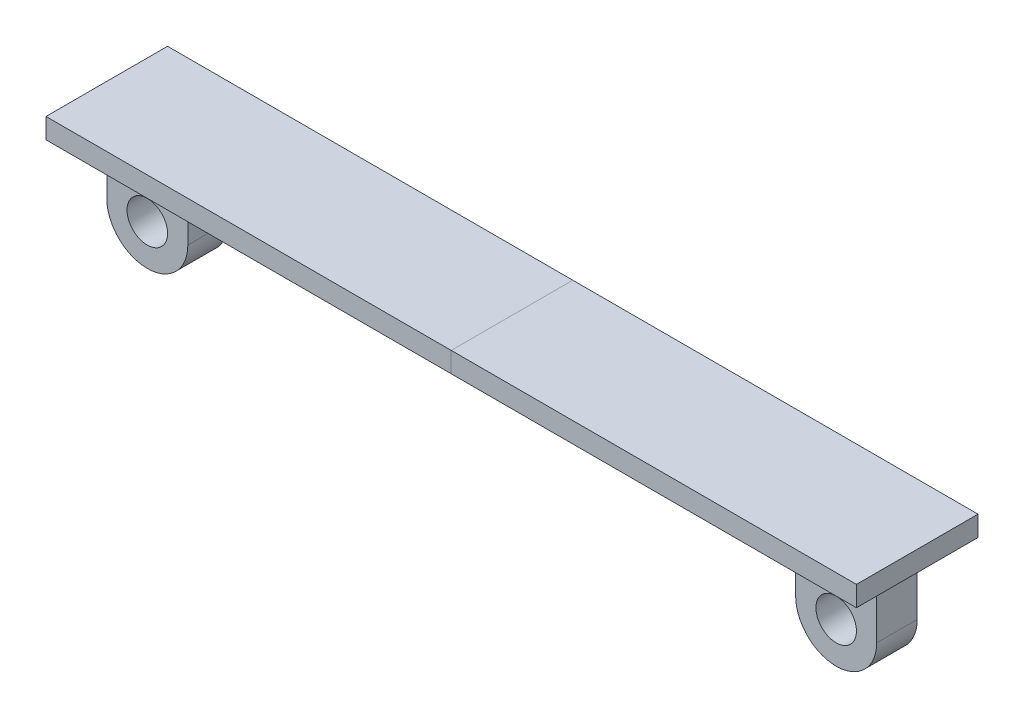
ISO-10303-21;
HEADER;
FILE_DESCRIPTION(('STEP AP214'),'2;1');
FILE_NAME('part.step','',(''),(''),'','','');
FILE_SCHEMA(('AUTOMOTIVE_DESIGN { 1 0 10303 214 1 1 1 1 }'));
ENDSEC;
DATA;
#1=APPLICATION_CONTEXT('core data for automotive mechanical design processes');
#2=APPLICATION_PROTOCOL_DEFINITION('international standard','automotive_design',2000,#1);
#3=PRODUCT_CONTEXT('',#1,'mechanical');
#4=PRODUCT('Part','Part','',(#3));
#5=PRODUCT_RELATED_PRODUCT_CATEGORY('part','',(#4));
#6=PRODUCT_DEFINITION_FORMATION('','',#4);
#7=PRODUCT_DEFINITION_CONTEXT('part definition',#1,'design');
#8=PRODUCT_DEFINITION('design','',#6,#7);
#9=PRODUCT_DEFINITION_SHAPE('','',#8);
#10=(LENGTH_UNIT() NAMED_UNIT(*) SI_UNIT(.MILLI.,.METRE.));
#11=(NAMED_UNIT(*) PLANE_ANGLE_UNIT() SI_UNIT($,.RADIAN.));
#12=(NAMED_UNIT(*) SI_UNIT($,.STERADIAN.) SOLID_ANGLE_UNIT());
#13=UNCERTAINTY_MEASURE_WITH_UNIT(LENGTH_MEASURE(1.E-05),#10,'distance_accuracy_value','');
#14=(GEOMETRIC_REPRESENTATION_CONTEXT(3) GLOBAL_UNCERTAINTY_ASSIGNED_CONTEXT((#13)) GLOBAL_UNIT_ASSIGNED_CONTEXT((#10,
#11,#12)) REPRESENTATION_CONTEXT('',''));
#15=CARTESIAN_POINT('',(0.,0.,0.));
#16=DIRECTION('',(0.,0.,1.));
#17=DIRECTION('',(1.,0.,0.));
#18=AXIS2_PLACEMENT_3D('',#15,#16,#17);
#19=CARTESIAN_POINT('',(-200.,-10.,-30.));
#20=DIRECTION('',(0.,1.,0.));
#21=DIRECTION('',(0.,0.,1.));
#22=AXIS2_PLACEMENT_3D('',#19,#20,#21);
#23=PLANE('',#22);
#24=DIRECTION('',(1.,0.,0.));
#25=VECTOR('',#24,1.);
#26=CARTESIAN_POINT('',(-190.,-10.,-9.99999999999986));
#27=LINE('',#26,#25);
#28=CARTESIAN_POINT('',(-195.,-10.,-9.99999999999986));
#29=VERTEX_POINT('',#28);
#30=CARTESIAN_POINT('',(-145.,-10.,-9.99999999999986));
#31=VERTEX_POINT('',#30);
#32=EDGE_CURVE('E387',#29,#31,#27,.T.);
#33=ORIENTED_EDGE('',*,*,#32,.F.);
#34=DIRECTION('',(0.,0.,-1.));
#35=VECTOR('',#34,1.);
#36=CARTESIAN_POINT('',(-195.,-10.,10.));
#37=LINE('',#36,#35);
#38=CARTESIAN_POINT('',(-195.,-10.,10.));
#39=VERTEX_POINT('',#38);
#40=EDGE_CURVE('E248',#29,#39,#37,.F.);
#41=ORIENTED_EDGE('',*,*,#40,.T.);
#42=DIRECTION('',(-1.,0.,0.));
#43=VECTOR('',#42,1.);
#44=CARTESIAN_POINT('',(-190.,-10.,10.));
#45=LINE('',#44,#43);
#46=CARTESIAN_POINT('',(-145.,-10.,10.));
#47=VERTEX_POINT('',#46);
#48=EDGE_CURVE('E389',#47,#39,#45,.T.);
#49=ORIENTED_EDGE('',*,*,#48,.F.);
#50=DIRECTION('',(0.,0.,1.));
#51=VECTOR('',#50,1.);
#52=CARTESIAN_POINT('',(-145.,-10.,-9.99999999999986));
#53=LINE('',#52,#51);
#54=EDGE_CURVE('E245',#47,#31,#53,.F.);
#55=ORIENTED_EDGE('',*,*,#54,.T.);
#56=EDGE_LOOP('',(#33,#41,#49,#55));
#57=FACE_BOUND('',#56,.T.);
#58=DIRECTION('',(0.,0.,-1.));
#59=VECTOR('',#58,1.);
#60=CARTESIAN_POINT('',(0.,-10.,-30.));
#61=LINE('',#60,#59);
#62=CARTESIAN_POINT('',(0.,-10.,30.));
#63=VERTEX_POINT('',#62);
#64=CARTESIAN_POINT('',(0.,-10.,-30.));
#65=VERTEX_POINT('',#64);
#66=EDGE_CURVE('E11',#63,#65,#61,.T.);
#67=ORIENTED_EDGE('',*,*,#66,.F.);
#68=DIRECTION('',(1.,0.,0.));
#69=VECTOR('',#68,1.);
#70=CARTESIAN_POINT('',(-200.,-10.,30.));
#71=LINE('',#70,#69);
#72=CARTESIAN_POINT('',(-200.,-10.,30.));
#73=VERTEX_POINT('',#72);
#74=EDGE_CURVE('E210',#73,#63,#71,.T.);
#75=ORIENTED_EDGE('',*,*,#74,.F.);
#76=DIRECTION('',(0.,0.,1.));
#77=VECTOR('',#76,1.);
#78=CARTESIAN_POINT('',(-200.,-10.,-30.));
#79=LINE('',#78,#77);
#80=CARTESIAN_POINT('',(-200.,-10.,-30.));
#81=VERTEX_POINT('',#80);
#82=EDGE_CURVE('E176',#81,#73,#79,.T.);
#83=ORIENTED_EDGE('',*,*,#82,.F.);
#84=DIRECTION('',(-1.,0.,0.));
#85=VECTOR('',#84,1.);
#86=CARTESIAN_POINT('',(-200.,-10.,-30.));
#87=LINE('',#86,#85);
#88=EDGE_CURVE('E215',#65,#81,#87,.T.);
#89=ORIENTED_EDGE('',*,*,#88,.F.);
#90=EDGE_LOOP('',(#67,#75,#83,#89));
#91=FACE_BOUND('',#90,.T.);
#92=ADVANCED_FACE('F32',(#57,#91),#23,.F.);
#93=CARTESIAN_POINT('',(-200.,-10.,-30.));
#94=DIRECTION('',(0.,0.,-1.));
#95=DIRECTION('',(-1.,0.,0.));
#96=AXIS2_PLACEMENT_3D('',#93,#94,#95);
#97=PLANE('',#96);
#98=DIRECTION('',(-1.,0.,0.));
#99=VECTOR('',#98,1.);
#100=CARTESIAN_POINT('',(-200.,0.,-30.));
#101=LINE('',#100,#99);
#102=CARTESIAN_POINT('',(0.,0.,-30.));
#103=VERTEX_POINT('',#102);
#104=CARTESIAN_POINT('',(-200.,0.,-30.));
#105=VERTEX_POINT('',#104);
#106=EDGE_CURVE('E194',#103,#105,#101,.T.);
#107=ORIENTED_EDGE('',*,*,#106,.F.);
#108=DIRECTION('',(0.,-1.,0.));
#109=VECTOR('',#108,1.);
#110=CARTESIAN_POINT('',(0.,-10.,-30.));
#111=LINE('',#110,#109);
#112=EDGE_CURVE('E42',#103,#65,#111,.T.);
#113=ORIENTED_EDGE('',*,*,#112,.T.);
#114=ORIENTED_EDGE('',*,*,#88,.T.);
#115=DIRECTION('',(0.,1.,0.));
#116=VECTOR('',#115,1.);
#117=CARTESIAN_POINT('',(-200.,-10.,-30.));
#118=LINE('',#117,#116);
#119=EDGE_CURVE('E218',#81,#105,#118,.T.);
#120=ORIENTED_EDGE('',*,*,#119,.T.);
#121=EDGE_LOOP('',(#107,#113,#114,#120));
#122=FACE_BOUND('',#121,.T.);
#123=ADVANCED_FACE('F303',(#122),#97,.T.);
#124=CARTESIAN_POINT('',(-200.,-10.,30.));
#125=DIRECTION('',(0.,0.,1.));
#126=DIRECTION('',(1.,0.,0.));
#127=AXIS2_PLACEMENT_3D('',#124,#125,#126);
#128=PLANE('',#127);
#129=ORIENTED_EDGE('',*,*,#74,.T.);
#130=DIRECTION('',(0.,1.,0.));
#131=VECTOR('',#130,1.);
#132=CARTESIAN_POINT('',(0.,-10.,30.));
#133=LINE('',#132,#131);
#134=CARTESIAN_POINT('',(0.,0.,30.));
#135=VERTEX_POINT('',#134);
#136=EDGE_CURVE('E185',#63,#135,#133,.T.);
#137=ORIENTED_EDGE('',*,*,#136,.T.);
#138=DIRECTION('',(1.,0.,0.));
#139=VECTOR('',#138,1.);
#140=CARTESIAN_POINT('',(-200.,0.,30.));
#141=LINE('',#140,#139);
#142=CARTESIAN_POINT('',(-200.,0.,30.));
#143=VERTEX_POINT('',#142);
#144=EDGE_CURVE('E183',#143,#135,#141,.T.);
#145=ORIENTED_EDGE('',*,*,#144,.F.);
#146=DIRECTION('',(0.,1.,0.));
#147=VECTOR('',#146,1.);
#148=CARTESIAN_POINT('',(-200.,-10.,30.));
#149=LINE('',#148,#147);
#150=EDGE_CURVE('E170',#73,#143,#149,.T.);
#151=ORIENTED_EDGE('',*,*,#150,.F.);
#152=EDGE_LOOP('',(#129,#137,#145,#151));
#153=FACE_BOUND('',#152,.T.);
#154=ADVANCED_FACE('F184',(#153),#128,.T.);
#155=CARTESIAN_POINT('',(-200.,0.,-30.));
#156=DIRECTION('',(0.,1.,0.));
#157=DIRECTION('',(0.,0.,1.));
#158=AXIS2_PLACEMENT_3D('',#155,#156,#157);
#159=PLANE('',#158);
#160=ORIENTED_EDGE('',*,*,#144,.T.);
#161=DIRECTION('',(0.,0.,-1.));
#162=VECTOR('',#161,1.);
#163=CARTESIAN_POINT('',(0.,0.,-30.));
#164=LINE('',#163,#162);
#165=EDGE_CURVE('E36',#135,#103,#164,.T.);
#166=ORIENTED_EDGE('',*,*,#165,.T.);
#167=ORIENTED_EDGE('',*,*,#106,.T.);
#168=DIRECTION('',(0.,0.,1.));
#169=VECTOR('',#168,1.);
#170=CARTESIAN_POINT('',(-200.,0.,-30.));
#171=LINE('',#170,#169);
#172=EDGE_CURVE('E174',#105,#143,#171,.T.);
#173=ORIENTED_EDGE('',*,*,#172,.T.);
#174=EDGE_LOOP('',(#160,#166,#167,#173));
#175=FACE_BOUND('',#174,.T.);
#176=ADVANCED_FACE('F192',(#175),#159,.T.);
#177=CARTESIAN_POINT('',(190.,-60.,10.));
#178=DIRECTION('',(0.,0.,1.));
#179=DIRECTION('',(1.,0.,0.));
#180=AXIS2_PLACEMENT_3D('',#177,#178,#179);
#181=PLANE('',#180);
#182=DIRECTION('',(0.,1.,0.));
#183=VECTOR('',#182,1.);
#184=CARTESIAN_POINT('',(150.,-60.,10.));
#185=LINE('',#184,#183);
#186=CARTESIAN_POINT('',(150.,-40.,10.));
#187=VERTEX_POINT('',#186);
#188=CARTESIAN_POINT('',(150.,-15.,10.));
#189=VERTEX_POINT('',#188);
#190=EDGE_CURVE('E374',#187,#189,#185,.T.);
#191=ORIENTED_EDGE('',*,*,#190,.F.);
#192=CARTESIAN_POINT('',(170.,-40.,10.));
#193=DIRECTION('',(0.,0.,1.));
#194=DIRECTION('',(1.,0.,0.));
#195=AXIS2_PLACEMENT_3D('',#192,#193,#194);
#196=CIRCLE('',#195,20.);
#197=CARTESIAN_POINT('',(170.,-60.,10.));
#198=VERTEX_POINT('',#197);
#199=EDGE_CURVE('E269',#187,#198,#196,.T.);
#200=ORIENTED_EDGE('',*,*,#199,.T.);
#201=CARTESIAN_POINT('',(170.,-40.,10.));
#202=DIRECTION('',(0.,0.,1.));
#203=DIRECTION('',(1.,0.,0.));
#204=AXIS2_PLACEMENT_3D('',#201,#202,#203);
#205=CIRCLE('',#204,20.);
#206=CARTESIAN_POINT('',(190.,-40.,10.));
#207=VERTEX_POINT('',#206);
#208=EDGE_CURVE('E267',#198,#207,#205,.T.);
#209=ORIENTED_EDGE('',*,*,#208,.T.);
#210=DIRECTION('',(0.,1.,0.));
#211=VECTOR('',#210,1.);
#212=CARTESIAN_POINT('',(190.,-60.,10.));
#213=LINE('',#212,#211);
#214=CARTESIAN_POINT('',(190.,-15.,10.));
#215=VERTEX_POINT('',#214);
#216=EDGE_CURVE('E381',#207,#215,#213,.T.);
#217=ORIENTED_EDGE('',*,*,#216,.T.);
#218=CARTESIAN_POINT('',(195.,-15.,10.));
#219=DIRECTION('',(0.,0.,1.));
#220=DIRECTION('',(1.,0.,0.));
#221=AXIS2_PLACEMENT_3D('',#218,#219,#220);
#222=CIRCLE('',#221,5.);
#223=CARTESIAN_POINT('',(195.,-10.,10.));
#224=VERTEX_POINT('',#223);
#225=EDGE_CURVE('E289',#215,#224,#222,.F.);
#226=ORIENTED_EDGE('',*,*,#225,.T.);
#227=DIRECTION('',(1.,0.,0.));
#228=VECTOR('',#227,1.);
#229=CARTESIAN_POINT('',(190.,-10.,10.));
#230=LINE('',#229,#228);
#231=CARTESIAN_POINT('',(145.,-10.,10.));
#232=VERTEX_POINT('',#231);
#233=EDGE_CURVE('E355',#232,#224,#230,.T.);
#234=ORIENTED_EDGE('',*,*,#233,.F.);
#235=CARTESIAN_POINT('',(145.,-15.,10.));
#236=DIRECTION('',(0.,0.,1.));
#237=DIRECTION('',(1.,0.,0.));
#238=AXIS2_PLACEMENT_3D('',#235,#236,#237);
#239=CIRCLE('',#238,5.);
#240=EDGE_CURVE('E292',#232,#189,#239,.F.);
#241=ORIENTED_EDGE('',*,*,#240,.T.);
#242=EDGE_LOOP('',(#191,#200,#209,#217,#226,#234,#241));
#243=FACE_BOUND('',#242,.T.);
#244=CARTESIAN_POINT('',(170.,-40.,10.));
#245=DIRECTION('',(0.,0.,1.));
#246=DIRECTION('',(1.,0.,0.));
#247=AXIS2_PLACEMENT_3D('',#244,#245,#246);
#248=CIRCLE('',#247,10.);
#249=CARTESIAN_POINT('',(160.,-40.,10.));
#250=VERTEX_POINT('',#249);
#251=EDGE_CURVE('E621',#250,#250,#248,.F.);
#252=ORIENTED_EDGE('',*,*,#251,.T.);
#253=EDGE_LOOP('',(#252));
#254=FACE_BOUND('',#253,.T.);
#255=ADVANCED_FACE('F335',(#243,#254),#181,.T.);
#256=CARTESIAN_POINT('',(190.,-60.,-9.99999999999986));
#257=DIRECTION('',(0.,0.,-1.));
#258=DIRECTION('',(-1.,0.,0.));
#259=AXIS2_PLACEMENT_3D('',#256,#257,#258);
#260=PLANE('',#259);
#261=CARTESIAN_POINT('',(170.,-40.,-9.99999999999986));
#262=DIRECTION('',(0.,0.,-1.));
#263=DIRECTION('',(-1.,0.,0.));
#264=AXIS2_PLACEMENT_3D('',#261,#262,#263);
#265=CIRCLE('',#264,20.);
#266=CARTESIAN_POINT('',(190.,-40.,-9.99999999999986));
#267=VERTEX_POINT('',#266);
#268=CARTESIAN_POINT('',(170.,-60.,-9.99999999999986));
#269=VERTEX_POINT('',#268);
#270=EDGE_CURVE('E271',#267,#269,#265,.T.);
#271=ORIENTED_EDGE('',*,*,#270,.T.);
#272=CARTESIAN_POINT('',(170.,-40.,-9.99999999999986));
#273=DIRECTION('',(0.,0.,-1.));
#274=DIRECTION('',(-1.,0.,0.));
#275=AXIS2_PLACEMENT_3D('',#272,#273,#274);
#276=CIRCLE('',#275,20.);
#277=CARTESIAN_POINT('',(150.,-40.,-9.99999999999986));
#278=VERTEX_POINT('',#277);
#279=EDGE_CURVE('E273',#269,#278,#276,.T.);
#280=ORIENTED_EDGE('',*,*,#279,.T.);
#281=DIRECTION('',(0.,1.,0.));
#282=VECTOR('',#281,1.);
#283=CARTESIAN_POINT('',(150.,-60.,-9.99999999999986));
#284=LINE('',#283,#282);
#285=CARTESIAN_POINT('',(150.,-15.,-9.99999999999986));
#286=VERTEX_POINT('',#285);
#287=EDGE_CURVE('E371',#278,#286,#284,.T.);
#288=ORIENTED_EDGE('',*,*,#287,.T.);
#289=CARTESIAN_POINT('',(145.,-15.,-9.99999999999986));
#290=DIRECTION('',(0.,0.,-1.));
#291=DIRECTION('',(-1.,0.,0.));
#292=AXIS2_PLACEMENT_3D('',#289,#290,#291);
#293=CIRCLE('',#292,5.);
#294=CARTESIAN_POINT('',(145.,-10.,-9.99999999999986));
#295=VERTEX_POINT('',#294);
#296=EDGE_CURVE('E294',#286,#295,#293,.F.);
#297=ORIENTED_EDGE('',*,*,#296,.T.);
#298=DIRECTION('',(-1.,0.,0.));
#299=VECTOR('',#298,1.);
#300=CARTESIAN_POINT('',(190.,-10.,-9.99999999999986));
#301=LINE('',#300,#299);
#302=CARTESIAN_POINT('',(195.,-10.,-9.99999999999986));
#303=VERTEX_POINT('',#302);
#304=EDGE_CURVE('E354',#303,#295,#301,.T.);
#305=ORIENTED_EDGE('',*,*,#304,.F.);
#306=CARTESIAN_POINT('',(195.,-15.,-9.99999999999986));
#307=DIRECTION('',(0.,0.,-1.));
#308=DIRECTION('',(-1.,0.,0.));
#309=AXIS2_PLACEMENT_3D('',#306,#307,#308);
#310=CIRCLE('',#309,5.);
#311=CARTESIAN_POINT('',(190.,-15.,-9.99999999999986));
#312=VERTEX_POINT('',#311);
#313=EDGE_CURVE('E287',#303,#312,#310,.F.);
#314=ORIENTED_EDGE('',*,*,#313,.T.);
#315=DIRECTION('',(0.,1.,0.));
#316=VECTOR('',#315,1.);
#317=CARTESIAN_POINT('',(190.,-60.,-9.99999999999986));
#318=LINE('',#317,#316);
#319=EDGE_CURVE('E364',#267,#312,#318,.T.);
#320=ORIENTED_EDGE('',*,*,#319,.F.);
#321=EDGE_LOOP('',(#271,#280,#288,#297,#305,#314,#320));
#322=FACE_BOUND('',#321,.T.);
#323=CARTESIAN_POINT('',(170.,-40.,-9.99999999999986));
#324=DIRECTION('',(0.,0.,1.));
#325=DIRECTION('',(1.,0.,0.));
#326=AXIS2_PLACEMENT_3D('',#323,#324,#325);
#327=CIRCLE('',#326,10.);
#328=CARTESIAN_POINT('',(160.,-40.,-9.99999999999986));
#329=VERTEX_POINT('',#328);
#330=EDGE_CURVE('E624',#329,#329,#327,.T.);
#331=ORIENTED_EDGE('',*,*,#330,.T.);
#332=EDGE_LOOP('',(#331));
#333=FACE_BOUND('',#332,.T.);
#334=ADVANCED_FACE('F344',(#322,#333),#260,.T.);
#335=DIRECTION('',(0.,0.,-1.));
#336=VECTOR('',#335,1.);
#337=CARTESIAN_POINT('',(195.,-10.,-29.9999999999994));
#338=LINE('',#337,#336);
#339=EDGE_CURVE('E280',#224,#303,#338,.T.);
#340=ORIENTED_EDGE('',*,*,#339,.T.);
#341=ORIENTED_EDGE('',*,*,#304,.T.);
#342=DIRECTION('',(0.,0.,1.));
#343=VECTOR('',#342,1.);
#344=CARTESIAN_POINT('',(145.,-10.,-30.));
#345=LINE('',#344,#343);
#346=EDGE_CURVE('E277',#295,#232,#345,.T.);
#347=ORIENTED_EDGE('',*,*,#346,.T.);
#348=ORIENTED_EDGE('',*,*,#233,.T.);
#349=EDGE_LOOP('',(#340,#341,#347,#348));
#350=FACE_BOUND('',#349,.T.);
#351=CARTESIAN_POINT('',(200.,-10.,30.));
#352=VERTEX_POINT('',#351);
#353=EDGE_CURVE('E209',#63,#352,#71,.T.);
#354=ORIENTED_EDGE('',*,*,#353,.F.);
#355=ORIENTED_EDGE('',*,*,#66,.T.);
#356=CARTESIAN_POINT('',(200.,-10.,-30.));
#357=VERTEX_POINT('',#356);
#358=EDGE_CURVE('E180',#357,#65,#87,.T.);
#359=ORIENTED_EDGE('',*,*,#358,.F.);
#360=DIRECTION('',(0.,0.,-1.));
#361=VECTOR('',#360,1.);
#362=CARTESIAN_POINT('',(200.,-10.,-30.));
#363=LINE('',#362,#361);
#364=EDGE_CURVE('E212',#352,#357,#363,.T.);
#365=ORIENTED_EDGE('',*,*,#364,.F.);
#366=EDGE_LOOP('',(#354,#355,#359,#365));
#367=FACE_BOUND('',#366,.T.);
#368=ADVANCED_FACE('F308',(#350,#367),#23,.F.);
#369=CARTESIAN_POINT('',(-200.,-10.,-30.));
#370=DIRECTION('',(-1.,0.,0.));
#371=DIRECTION('',(0.,0.,1.));
#372=AXIS2_PLACEMENT_3D('',#369,#370,#371);
#373=PLANE('',#372);
#374=ORIENTED_EDGE('',*,*,#172,.F.);
#375=ORIENTED_EDGE('',*,*,#119,.F.);
#376=ORIENTED_EDGE('',*,*,#82,.T.);
#377=ORIENTED_EDGE('',*,*,#150,.T.);
#378=EDGE_LOOP('',(#374,#375,#376,#377));
#379=FACE_BOUND('',#378,.T.);
#380=ADVANCED_FACE('F34',(#379),#373,.T.);
#381=ORIENTED_EDGE('',*,*,#112,.F.);
#382=CARTESIAN_POINT('',(200.,0.,-30.));
#383=VERTEX_POINT('',#382);
#384=EDGE_CURVE('E205',#383,#103,#101,.T.);
#385=ORIENTED_EDGE('',*,*,#384,.F.);
#386=DIRECTION('',(0.,1.,0.));
#387=VECTOR('',#386,1.);
#388=CARTESIAN_POINT('',(200.,-10.,-30.));
#389=LINE('',#388,#387);
#390=EDGE_CURVE('E221',#357,#383,#389,.T.);
#391=ORIENTED_EDGE('',*,*,#390,.F.);
#392=ORIENTED_EDGE('',*,*,#358,.T.);
#393=EDGE_LOOP('',(#381,#385,#391,#392));
#394=FACE_BOUND('',#393,.T.);
#395=ADVANCED_FACE('F306',(#394),#97,.T.);
#396=CARTESIAN_POINT('',(200.,-10.,-30.));
#397=DIRECTION('',(1.,0.,0.));
#398=DIRECTION('',(0.,0.,-1.));
#399=AXIS2_PLACEMENT_3D('',#396,#397,#398);
#400=PLANE('',#399);
#401=DIRECTION('',(0.,0.,-1.));
#402=VECTOR('',#401,1.);
#403=CARTESIAN_POINT('',(200.,0.,-30.));
#404=LINE('',#403,#402);
#405=CARTESIAN_POINT('',(200.,0.,30.));
#406=VERTEX_POINT('',#405);
#407=EDGE_CURVE('E189',#406,#383,#404,.T.);
#408=ORIENTED_EDGE('',*,*,#407,.F.);
#409=DIRECTION('',(0.,1.,0.));
#410=VECTOR('',#409,1.);
#411=CARTESIAN_POINT('',(200.,-10.,30.));
#412=LINE('',#411,#410);
#413=EDGE_CURVE('E179',#352,#406,#412,.T.);
#414=ORIENTED_EDGE('',*,*,#413,.F.);
#415=ORIENTED_EDGE('',*,*,#364,.T.);
#416=ORIENTED_EDGE('',*,*,#390,.T.);
#417=EDGE_LOOP('',(#408,#414,#415,#416));
#418=FACE_BOUND('',#417,.T.);
#419=ADVANCED_FACE('F312',(#418),#400,.T.);
#420=ORIENTED_EDGE('',*,*,#136,.F.);
#421=ORIENTED_EDGE('',*,*,#353,.T.);
#422=ORIENTED_EDGE('',*,*,#413,.T.);
#423=EDGE_CURVE('E190',#135,#406,#141,.T.);
#424=ORIENTED_EDGE('',*,*,#423,.F.);
#425=EDGE_LOOP('',(#420,#421,#422,#424));
#426=FACE_BOUND('',#425,.T.);
#427=ADVANCED_FACE('F315',(#426),#128,.T.);
#428=ORIENTED_EDGE('',*,*,#165,.F.);
#429=ORIENTED_EDGE('',*,*,#423,.T.);
#430=ORIENTED_EDGE('',*,*,#407,.T.);
#431=ORIENTED_EDGE('',*,*,#384,.T.);
#432=EDGE_LOOP('',(#428,#429,#430,#431));
#433=FACE_BOUND('',#432,.T.);
#434=ADVANCED_FACE('F317',(#433),#159,.T.);
#435=CARTESIAN_POINT('',(-190.,-60.,-9.99999999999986));
#436=DIRECTION('',(1.,0.,0.));
#437=DIRECTION('',(0.,0.,-1.));
#438=AXIS2_PLACEMENT_3D('',#435,#436,#437);
#439=PLANE('',#438);
#440=DIRECTION('',(0.,1.,0.));
#441=VECTOR('',#440,1.);
#442=CARTESIAN_POINT('',(-190.,-60.,10.));
#443=LINE('',#442,#441);
#444=CARTESIAN_POINT('',(-190.,-40.,10.));
#445=VERTEX_POINT('',#444);
#446=CARTESIAN_POINT('',(-190.,-15.,10.));
#447=VERTEX_POINT('',#446);
#448=EDGE_CURVE('E391',#445,#447,#443,.T.);
#449=ORIENTED_EDGE('',*,*,#448,.T.);
#450=DIRECTION('',(0.,0.,-1.));
#451=VECTOR('',#450,1.);
#452=CARTESIAN_POINT('',(-190.,-15.,-9.99999999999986));
#453=LINE('',#452,#451);
#454=CARTESIAN_POINT('',(-190.,-15.,-9.99999999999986));
#455=VERTEX_POINT('',#454);
#456=EDGE_CURVE('E237',#447,#455,#453,.T.);
#457=ORIENTED_EDGE('',*,*,#456,.T.);
#458=DIRECTION('',(0.,1.,0.));
#459=VECTOR('',#458,1.);
#460=CARTESIAN_POINT('',(-190.,-60.,-9.99999999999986));
#461=LINE('',#460,#459);
#462=CARTESIAN_POINT('',(-190.,-40.,-9.99999999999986));
#463=VERTEX_POINT('',#462);
#464=EDGE_CURVE('E196',#463,#455,#461,.T.);
#465=ORIENTED_EDGE('',*,*,#464,.F.);
#466=DIRECTION('',(0.,0.,-1.));
#467=VECTOR('',#466,1.);
#468=CARTESIAN_POINT('',(-190.,-40.,-9.99999999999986));
#469=LINE('',#468,#467);
#470=EDGE_CURVE('E235',#463,#445,#469,.F.);
#471=ORIENTED_EDGE('',*,*,#470,.T.);
#472=EDGE_LOOP('',(#449,#457,#465,#471));
#473=FACE_BOUND('',#472,.T.);
#474=ADVANCED_FACE('F324',(#473),#439,.F.);
#475=CARTESIAN_POINT('',(-190.,-60.,-9.99999999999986));
#476=DIRECTION('',(0.,0.,1.));
#477=DIRECTION('',(1.,0.,0.));
#478=AXIS2_PLACEMENT_3D('',#475,#476,#477);
#479=PLANE('',#478);
#480=CARTESIAN_POINT('',(-170.,-40.,-9.99999999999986));
#481=DIRECTION('',(0.,0.,-1.));
#482=DIRECTION('',(-1.,0.,0.));
#483=AXIS2_PLACEMENT_3D('',#480,#481,#482);
#484=CIRCLE('',#483,10.);
#485=CARTESIAN_POINT('',(-180.,-40.,-9.99999999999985));
#486=VERTEX_POINT('',#485);
#487=EDGE_CURVE('E242',#486,#486,#484,.T.);
#488=ORIENTED_EDGE('',*,*,#487,.F.);
#489=EDGE_LOOP('',(#488));
#490=FACE_BOUND('',#489,.T.);
#491=DIRECTION('',(0.,1.,0.));
#492=VECTOR('',#491,1.);
#493=CARTESIAN_POINT('',(-150.,-60.,-9.99999999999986));
#494=LINE('',#493,#492);
#495=CARTESIAN_POINT('',(-150.,-40.,-9.99999999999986));
#496=VERTEX_POINT('',#495);
#497=CARTESIAN_POINT('',(-150.,-15.,-9.99999999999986));
#498=VERTEX_POINT('',#497);
#499=EDGE_CURVE('E199',#496,#498,#494,.T.);
#500=ORIENTED_EDGE('',*,*,#499,.F.);
#501=CARTESIAN_POINT('',(-170.,-40.,-9.99999999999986));
#502=DIRECTION('',(0.,0.,1.));
#503=DIRECTION('',(1.,0.,0.));
#504=AXIS2_PLACEMENT_3D('',#501,#502,#503);
#505=CIRCLE('',#504,20.);
#506=CARTESIAN_POINT('',(-170.,-60.,-9.99999999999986));
#507=VERTEX_POINT('',#506);
#508=EDGE_CURVE('E233',#496,#507,#505,.F.);
#509=ORIENTED_EDGE('',*,*,#508,.T.);
#510=CARTESIAN_POINT('',(-170.,-40.,-9.99999999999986));
#511=DIRECTION('',(0.,0.,1.));
#512=DIRECTION('',(1.,0.,0.));
#513=AXIS2_PLACEMENT_3D('',#510,#511,#512);
#514=CIRCLE('',#513,20.);
#515=EDGE_CURVE('E231',#507,#463,#514,.F.);
#516=ORIENTED_EDGE('',*,*,#515,.T.);
#517=ORIENTED_EDGE('',*,*,#464,.T.);
#518=CARTESIAN_POINT('',(-195.,-15.,-9.99999999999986));
#519=DIRECTION('',(0.,0.,1.));
#520=DIRECTION('',(1.,0.,0.));
#521=AXIS2_PLACEMENT_3D('',#518,#519,#520);
#522=CIRCLE('',#521,5.);
#523=EDGE_CURVE('E254',#455,#29,#522,.T.);
#524=ORIENTED_EDGE('',*,*,#523,.T.);
#525=ORIENTED_EDGE('',*,*,#32,.T.);
#526=CARTESIAN_POINT('',(-145.,-15.,-9.99999999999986));
#527=DIRECTION('',(0.,0.,1.));
#528=DIRECTION('',(1.,0.,0.));
#529=AXIS2_PLACEMENT_3D('',#526,#527,#528);
#530=CIRCLE('',#529,5.);
#531=EDGE_CURVE('E262',#31,#498,#530,.T.);
#532=ORIENTED_EDGE('',*,*,#531,.T.);
#533=EDGE_LOOP('',(#500,#509,#516,#517,#524,#525,#532));
#534=FACE_BOUND('',#533,.T.);
#535=ADVANCED_FACE('F330',(#490,#534),#479,.F.);
#536=CARTESIAN_POINT('',(-150.,-60.,-9.99999999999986));
#537=DIRECTION('',(-1.,0.,0.));
#538=DIRECTION('',(0.,0.,1.));
#539=AXIS2_PLACEMENT_3D('',#536,#537,#538);
#540=PLANE('',#539);
#541=ORIENTED_EDGE('',*,*,#499,.T.);
#542=DIRECTION('',(0.,0.,1.));
#543=VECTOR('',#542,1.);
#544=CARTESIAN_POINT('',(-150.,-15.,10.));
#545=LINE('',#544,#543);
#546=CARTESIAN_POINT('',(-150.,-15.,10.));
#547=VERTEX_POINT('',#546);
#548=EDGE_CURVE('E251',#498,#547,#545,.T.);
#549=ORIENTED_EDGE('',*,*,#548,.T.);
#550=DIRECTION('',(0.,1.,0.));
#551=VECTOR('',#550,1.);
#552=CARTESIAN_POINT('',(-150.,-60.,10.));
#553=LINE('',#552,#551);
#554=CARTESIAN_POINT('',(-150.,-40.,10.));
#555=VERTEX_POINT('',#554);
#556=EDGE_CURVE('E394',#555,#547,#553,.T.);
#557=ORIENTED_EDGE('',*,*,#556,.F.);
#558=DIRECTION('',(0.,0.,1.));
#559=VECTOR('',#558,1.);
#560=CARTESIAN_POINT('',(-150.,-40.,-9.99999999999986));
#561=LINE('',#560,#559);
#562=EDGE_CURVE('E228',#555,#496,#561,.F.);
#563=ORIENTED_EDGE('',*,*,#562,.T.);
#564=EDGE_LOOP('',(#541,#549,#557,#563));
#565=FACE_BOUND('',#564,.T.);
#566=ADVANCED_FACE('F400',(#565),#540,.F.);
#567=CARTESIAN_POINT('',(-190.,-60.,10.));
#568=DIRECTION('',(0.,0.,-1.));
#569=DIRECTION('',(-1.,0.,0.));
#570=AXIS2_PLACEMENT_3D('',#567,#568,#569);
#571=PLANE('',#570);
#572=CARTESIAN_POINT('',(-170.,-40.,10.));
#573=DIRECTION('',(0.,0.,-1.));
#574=DIRECTION('',(-1.,0.,0.));
#575=AXIS2_PLACEMENT_3D('',#572,#573,#574);
#576=CIRCLE('',#575,10.);
#577=CARTESIAN_POINT('',(-180.,-40.,10.));
#578=VERTEX_POINT('',#577);
#579=EDGE_CURVE('E238',#578,#578,#576,.T.);
#580=ORIENTED_EDGE('',*,*,#579,.T.);
#581=EDGE_LOOP('',(#580));
#582=FACE_BOUND('',#581,.T.);
#583=CARTESIAN_POINT('',(-170.,-40.,10.));
#584=DIRECTION('',(0.,0.,-1.));
#585=DIRECTION('',(-1.,0.,0.));
#586=AXIS2_PLACEMENT_3D('',#583,#584,#585);
#587=CIRCLE('',#586,20.);
#588=CARTESIAN_POINT('',(-170.,-60.,10.));
#589=VERTEX_POINT('',#588);
#590=EDGE_CURVE('E220',#445,#589,#587,.F.);
#591=ORIENTED_EDGE('',*,*,#590,.T.);
#592=CARTESIAN_POINT('',(-170.,-40.,10.));
#593=DIRECTION('',(0.,0.,-1.));
#594=DIRECTION('',(-1.,0.,0.));
#595=AXIS2_PLACEMENT_3D('',#592,#593,#594);
#596=CIRCLE('',#595,20.);
#597=EDGE_CURVE('E226',#589,#555,#596,.F.);
#598=ORIENTED_EDGE('',*,*,#597,.T.);
#599=ORIENTED_EDGE('',*,*,#556,.T.);
#600=CARTESIAN_POINT('',(-145.,-15.,10.));
#601=DIRECTION('',(0.,0.,-1.));
#602=DIRECTION('',(-1.,0.,0.));
#603=AXIS2_PLACEMENT_3D('',#600,#601,#602);
#604=CIRCLE('',#603,5.);
#605=EDGE_CURVE('E259',#547,#47,#604,.T.);
#606=ORIENTED_EDGE('',*,*,#605,.T.);
#607=ORIENTED_EDGE('',*,*,#48,.T.);
#608=CARTESIAN_POINT('',(-195.,-15.,10.));
#609=DIRECTION('',(0.,0.,-1.));
#610=DIRECTION('',(-1.,0.,0.));
#611=AXIS2_PLACEMENT_3D('',#608,#609,#610);
#612=CIRCLE('',#611,5.);
#613=EDGE_CURVE('E257',#39,#447,#612,.T.);
#614=ORIENTED_EDGE('',*,*,#613,.T.);
#615=ORIENTED_EDGE('',*,*,#448,.F.);
#616=EDGE_LOOP('',(#591,#598,#599,#606,#607,#614,#615));
#617=FACE_BOUND('',#616,.T.);
#618=ADVANCED_FACE('F409',(#582,#617),#571,.F.);
#619=CARTESIAN_POINT('',(-170.,-40.,9.99999999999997));
#620=DIRECTION('',(0.,0.,-1.));
#621=DIRECTION('',(-1.,0.,0.));
#622=AXIS2_PLACEMENT_3D('',#619,#620,#621);
#623=CYLINDRICAL_SURFACE('',#622,20.);
#624=ORIENTED_EDGE('',*,*,#470,.F.);
#625=ORIENTED_EDGE('',*,*,#515,.F.);
#626=DIRECTION('',(0.,0.,-1.));
#627=VECTOR('',#626,1.);
#628=CARTESIAN_POINT('',(-170.,-60.,9.99999999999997));
#629=LINE('',#628,#627);
#630=EDGE_CURVE('E241',#589,#507,#629,.T.);
#631=ORIENTED_EDGE('',*,*,#630,.F.);
#632=ORIENTED_EDGE('',*,*,#590,.F.);
#633=EDGE_LOOP('',(#624,#625,#631,#632));
#634=FACE_BOUND('',#633,.T.);
#635=ADVANCED_FACE('F418',(#634),#623,.T.);
#636=CARTESIAN_POINT('',(-170.,-40.,10.));
#637=DIRECTION('',(0.,0.,1.));
#638=DIRECTION('',(1.,0.,0.));
#639=AXIS2_PLACEMENT_3D('',#636,#637,#638);
#640=CYLINDRICAL_SURFACE('',#639,20.);
#641=ORIENTED_EDGE('',*,*,#508,.F.);
#642=ORIENTED_EDGE('',*,*,#562,.F.);
#643=ORIENTED_EDGE('',*,*,#597,.F.);
#644=ORIENTED_EDGE('',*,*,#630,.T.);
#645=EDGE_LOOP('',(#641,#642,#643,#644));
#646=FACE_BOUND('',#645,.T.);
#647=ADVANCED_FACE('F412',(#646),#640,.T.);
#648=CARTESIAN_POINT('',(-170.,-40.,30.));
#649=DIRECTION('',(0.,0.,-1.));
#650=DIRECTION('',(-1.,0.,0.));
#651=AXIS2_PLACEMENT_3D('',#648,#649,#650);
#652=CYLINDRICAL_SURFACE('',#651,10.);
#653=CARTESIAN_POINT('',(-180.,-40.,-9.99999999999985));
#654=CARTESIAN_POINT('',(-180.,-40.,-9.79166666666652));
#655=CARTESIAN_POINT('',(-180.,-40.,-9.58333333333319));
#656=CARTESIAN_POINT('',(-180.,-40.,-9.16666666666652));
#657=CARTESIAN_POINT('',(-180.,-40.,-8.95833333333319));
#658=CARTESIAN_POINT('',(-180.,-40.,-8.54166666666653));
#659=CARTESIAN_POINT('',(-180.,-40.,-8.33333333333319));
#660=CARTESIAN_POINT('',(-180.,-40.,-7.91666666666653));
#661=CARTESIAN_POINT('',(-180.,-40.,-7.7083333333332));
#662=CARTESIAN_POINT('',(-180.,-40.,-7.29166666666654));
#663=CARTESIAN_POINT('',(-180.,-40.,-7.08333333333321));
#664=CARTESIAN_POINT('',(-180.,-40.,-6.66666666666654));
#665=CARTESIAN_POINT('',(-180.,-40.,-6.45833333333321));
#666=CARTESIAN_POINT('',(-180.,-40.,-6.04166666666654));
#667=CARTESIAN_POINT('',(-180.,-40.,-5.83333333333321));
#668=CARTESIAN_POINT('',(-180.,-40.,-5.41666666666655));
#669=CARTESIAN_POINT('',(-180.,-40.,-5.20833333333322));
#670=CARTESIAN_POINT('',(-180.,-40.,-4.79166666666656));
#671=CARTESIAN_POINT('',(-180.,-40.,-4.58333333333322));
#672=CARTESIAN_POINT('',(-180.,-40.,-4.16666666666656));
#673=CARTESIAN_POINT('',(-180.,-40.,-3.95833333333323));
#674=CARTESIAN_POINT('',(-180.,-40.,-3.54166666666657));
#675=CARTESIAN_POINT('',(-180.,-40.,-3.33333333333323));
#676=CARTESIAN_POINT('',(-180.,-40.,-2.91666666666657));
#677=CARTESIAN_POINT('',(-180.,-40.,-2.70833333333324));
#678=CARTESIAN_POINT('',(-180.,-40.,-2.29166666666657));
#679=CARTESIAN_POINT('',(-180.,-40.,-2.08333333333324));
#680=CARTESIAN_POINT('',(-180.,-40.,-1.66666666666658));
#681=CARTESIAN_POINT('',(-180.,-40.,-1.45833333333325));
#682=CARTESIAN_POINT('',(-180.,-40.,-1.04166666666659));
#683=CARTESIAN_POINT('',(-180.,-40.,-0.833333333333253));
#684=CARTESIAN_POINT('',(-180.,-40.,-0.41666666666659));
#685=CARTESIAN_POINT('',(-180.,-40.,-0.208333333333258));
#686=CARTESIAN_POINT('',(-180.,-40.,0.208333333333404));
#687=CARTESIAN_POINT('',(-180.,-40.,0.416666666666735));
#688=CARTESIAN_POINT('',(-180.,-40.,0.833333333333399));
#689=CARTESIAN_POINT('',(-180.,-40.,1.04166666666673));
#690=CARTESIAN_POINT('',(-180.,-40.,1.4583333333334));
#691=CARTESIAN_POINT('',(-180.,-40.,1.66666666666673));
#692=CARTESIAN_POINT('',(-180.,-40.,2.08333333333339));
#693=CARTESIAN_POINT('',(-180.,-40.,2.29166666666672));
#694=CARTESIAN_POINT('',(-180.,-40.,2.70833333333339));
#695=CARTESIAN_POINT('',(-180.,-40.,2.91666666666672));
#696=CARTESIAN_POINT('',(-180.,-40.,3.33333333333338));
#697=CARTESIAN_POINT('',(-180.,-40.,3.54166666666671));
#698=CARTESIAN_POINT('',(-180.,-40.,3.95833333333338));
#699=CARTESIAN_POINT('',(-180.,-40.,4.16666666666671));
#700=CARTESIAN_POINT('',(-180.,-40.,4.58333333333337));
#701=CARTESIAN_POINT('',(-180.,-40.,4.7916666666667));
#702=CARTESIAN_POINT('',(-180.,-40.,5.20833333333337));
#703=CARTESIAN_POINT('',(-180.,-40.,5.4166666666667));
#704=CARTESIAN_POINT('',(-180.,-40.,5.83333333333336));
#705=CARTESIAN_POINT('',(-180.,-40.,6.04166666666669));
#706=CARTESIAN_POINT('',(-180.,-40.,6.45833333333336));
#707=CARTESIAN_POINT('',(-180.,-40.,6.66666666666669));
#708=CARTESIAN_POINT('',(-180.,-40.,7.08333333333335));
#709=CARTESIAN_POINT('',(-180.,-40.,7.29166666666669));
#710=CARTESIAN_POINT('',(-180.,-40.,7.70833333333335));
#711=CARTESIAN_POINT('',(-180.,-40.,7.91666666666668));
#712=CARTESIAN_POINT('',(-180.,-40.,8.33333333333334));
#713=CARTESIAN_POINT('',(-180.,-40.,8.54166666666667));
#714=CARTESIAN_POINT('',(-180.,-40.,8.95833333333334));
#715=CARTESIAN_POINT('',(-180.,-40.,9.16666666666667));
#716=CARTESIAN_POINT('',(-180.,-40.,9.58333333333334));
#717=CARTESIAN_POINT('',(-180.,-40.,9.79166666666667));
#718=CARTESIAN_POINT('',(-180.,-40.,10.));
#719=B_SPLINE_CURVE_WITH_KNOTS('',3,(#653,#654,#655,#656,#657,#658,#659,#660,#661,#662,#663,
#664,#665,#666,#667,#668,#669,#670,#671,#672,#673,#674,#675,#676,#677,#678,#679,#680,#681,#682,
#683,#684,#685,#686,#687,#688,#689,#690,#691,#692,#693,#694,#695,#696,#697,#698,#699,#700,#701,
#702,#703,#704,#705,#706,#707,#708,#709,#710,#711,#712,#713,#714,#715,#716,#717,#718),
.UNSPECIFIED.,.F.,.F.,(4,2,2,2,2,2,2,2,2,2,2,2,2,2,2,2,2,2,2,2,2,2,2,2,2,2,2,2,2,2,2,2,4),(0.,
0.624999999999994,1.24999999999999,1.87499999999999,2.49999999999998,3.12499999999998,
3.74999999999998,4.37499999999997,4.99999999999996,5.62499999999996,6.24999999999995,
6.87499999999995,7.49999999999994,8.12499999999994,8.74999999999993,9.37499999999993,
9.99999999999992,10.6249999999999,11.2499999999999,11.8749999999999,12.4999999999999,
13.1249999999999,13.7499999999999,14.3749999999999,14.9999999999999,15.6249999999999,
16.2499999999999,16.8749999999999,17.4999999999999,18.1249999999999,18.7499999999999,
19.3749999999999,19.9999999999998),.UNSPECIFIED.);
#720=EDGE_CURVE('BSEAM427',#486,#578,#719,.T.);
#721=ORIENTED_EDGE('',*,*,#487,.T.);
#722=ORIENTED_EDGE('',*,*,#579,.F.);
#723=ORIENTED_EDGE('',*,*,#720,.T.);
#724=ORIENTED_EDGE('',*,*,#720,.F.);
#725=EDGE_LOOP('',(#721,#723,#722,#724));
#726=FACE_BOUND('',#725,.T.);
#727=ADVANCED_FACE('F427',(#726),#652,.F.);
#728=CARTESIAN_POINT('',(-195.,-15.,-9.99999999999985));
#729=DIRECTION('',(0.,0.,1.));
#730=DIRECTION('',(1.,0.,0.));
#731=AXIS2_PLACEMENT_3D('',#728,#729,#730);
#732=CYLINDRICAL_SURFACE('',#731,5.);
#733=ORIENTED_EDGE('',*,*,#613,.F.);
#734=ORIENTED_EDGE('',*,*,#40,.F.);
#735=ORIENTED_EDGE('',*,*,#523,.F.);
#736=ORIENTED_EDGE('',*,*,#456,.F.);
#737=EDGE_LOOP('',(#733,#734,#735,#736));
#738=FACE_BOUND('',#737,.T.);
#739=ADVANCED_FACE('F425',(#738),#732,.F.);
#740=CARTESIAN_POINT('',(-145.,-15.,-9.99999999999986));
#741=DIRECTION('',(0.,0.,-1.));
#742=DIRECTION('',(-1.,0.,0.));
#743=AXIS2_PLACEMENT_3D('',#740,#741,#742);
#744=CYLINDRICAL_SURFACE('',#743,5.);
#745=ORIENTED_EDGE('',*,*,#531,.F.);
#746=ORIENTED_EDGE('',*,*,#54,.F.);
#747=ORIENTED_EDGE('',*,*,#605,.F.);
#748=ORIENTED_EDGE('',*,*,#548,.F.);
#749=EDGE_LOOP('',(#745,#746,#747,#748));
#750=FACE_BOUND('',#749,.T.);
#751=ADVANCED_FACE('F406',(#750),#744,.F.);
#752=CARTESIAN_POINT('',(190.,-60.,-9.99999999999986));
#753=DIRECTION('',(1.,0.,0.));
#754=DIRECTION('',(0.,0.,-1.));
#755=AXIS2_PLACEMENT_3D('',#752,#753,#754);
#756=PLANE('',#755);
#757=ORIENTED_EDGE('',*,*,#319,.T.);
#758=DIRECTION('',(0.,0.,-1.));
#759=VECTOR('',#758,1.);
#760=CARTESIAN_POINT('',(190.,-15.,-9.99999999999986));
#761=LINE('',#760,#759);
#762=EDGE_CURVE('E283',#312,#215,#761,.F.);
#763=ORIENTED_EDGE('',*,*,#762,.T.);
#764=ORIENTED_EDGE('',*,*,#216,.F.);
#765=DIRECTION('',(0.,0.,-1.));
#766=VECTOR('',#765,1.);
#767=CARTESIAN_POINT('',(190.,-40.,-9.99999999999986));
#768=LINE('',#767,#766);
#769=EDGE_CURVE('E275',#207,#267,#768,.T.);
#770=ORIENTED_EDGE('',*,*,#769,.T.);
#771=EDGE_LOOP('',(#757,#763,#764,#770));
#772=FACE_BOUND('',#771,.T.);
#773=ADVANCED_FACE('F367',(#772),#756,.T.);
#774=CARTESIAN_POINT('',(150.,-60.,-9.99999999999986));
#775=DIRECTION('',(-1.,0.,0.));
#776=DIRECTION('',(0.,0.,1.));
#777=AXIS2_PLACEMENT_3D('',#774,#775,#776);
#778=PLANE('',#777);
#779=ORIENTED_EDGE('',*,*,#190,.T.);
#780=DIRECTION('',(0.,0.,1.));
#781=VECTOR('',#780,1.);
#782=CARTESIAN_POINT('',(150.,-15.,-9.99999999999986));
#783=LINE('',#782,#781);
#784=EDGE_CURVE('E285',#189,#286,#783,.F.);
#785=ORIENTED_EDGE('',*,*,#784,.T.);
#786=ORIENTED_EDGE('',*,*,#287,.F.);
#787=DIRECTION('',(0.,0.,1.));
#788=VECTOR('',#787,1.);
#789=CARTESIAN_POINT('',(150.,-40.,10.));
#790=LINE('',#789,#788);
#791=EDGE_CURVE('E264',#278,#187,#790,.T.);
#792=ORIENTED_EDGE('',*,*,#791,.T.);
#793=EDGE_LOOP('',(#779,#785,#786,#792));
#794=FACE_BOUND('',#793,.T.);
#795=ADVANCED_FACE('F491',(#794),#778,.T.);
#796=CARTESIAN_POINT('',(170.,-40.,-9.99999999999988));
#797=DIRECTION('',(0.,0.,1.));
#798=DIRECTION('',(1.,0.,0.));
#799=AXIS2_PLACEMENT_3D('',#796,#797,#798);
#800=CYLINDRICAL_SURFACE('',#799,20.);
#801=DIRECTION('',(0.,0.,-1.));
#802=VECTOR('',#801,1.);
#803=CARTESIAN_POINT('',(170.,-60.,9.99999999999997));
#804=LINE('',#803,#802);
#805=EDGE_CURVE('E618',#269,#198,#804,.F.);
#806=ORIENTED_EDGE('',*,*,#805,.F.);
#807=ORIENTED_EDGE('',*,*,#270,.F.);
#808=ORIENTED_EDGE('',*,*,#769,.F.);
#809=ORIENTED_EDGE('',*,*,#208,.F.);
#810=EDGE_LOOP('',(#806,#807,#808,#809));
#811=FACE_BOUND('',#810,.T.);
#812=ADVANCED_FACE('F497',(#811),#800,.T.);
#813=CARTESIAN_POINT('',(170.,-40.,-9.99999999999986));
#814=DIRECTION('',(0.,0.,-1.));
#815=DIRECTION('',(-1.,0.,0.));
#816=AXIS2_PLACEMENT_3D('',#813,#814,#815);
#817=CYLINDRICAL_SURFACE('',#816,20.);
#818=ORIENTED_EDGE('',*,*,#279,.F.);
#819=ORIENTED_EDGE('',*,*,#805,.T.);
#820=ORIENTED_EDGE('',*,*,#199,.F.);
#821=ORIENTED_EDGE('',*,*,#791,.F.);
#822=EDGE_LOOP('',(#818,#819,#820,#821));
#823=FACE_BOUND('',#822,.T.);
#824=ADVANCED_FACE('F505',(#823),#817,.T.);
#825=CARTESIAN_POINT('',(170.,-40.,30.));
#826=DIRECTION('',(0.,0.,-1.));
#827=DIRECTION('',(-1.,0.,0.));
#828=AXIS2_PLACEMENT_3D('',#825,#826,#827);
#829=CYLINDRICAL_SURFACE('',#828,10.);
#830=CARTESIAN_POINT('',(160.,-40.,10.));
#831=CARTESIAN_POINT('',(160.,-40.,9.79166666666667));
#832=CARTESIAN_POINT('',(160.,-40.,9.58333333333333));
#833=CARTESIAN_POINT('',(160.,-40.,9.16666666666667));
#834=CARTESIAN_POINT('',(160.,-40.,8.95833333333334));
#835=CARTESIAN_POINT('',(160.,-40.,8.54166666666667));
#836=CARTESIAN_POINT('',(160.,-40.,8.33333333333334));
#837=CARTESIAN_POINT('',(160.,-40.,7.91666666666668));
#838=CARTESIAN_POINT('',(160.,-40.,7.70833333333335));
#839=CARTESIAN_POINT('',(160.,-40.,7.29166666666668));
#840=CARTESIAN_POINT('',(160.,-40.,7.08333333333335));
#841=CARTESIAN_POINT('',(160.,-40.,6.66666666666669));
#842=CARTESIAN_POINT('',(160.,-40.,6.45833333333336));
#843=CARTESIAN_POINT('',(160.,-40.,6.04166666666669));
#844=CARTESIAN_POINT('',(160.,-40.,5.83333333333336));
#845=CARTESIAN_POINT('',(160.,-40.,5.4166666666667));
#846=CARTESIAN_POINT('',(160.,-40.,5.20833333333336));
#847=CARTESIAN_POINT('',(160.,-40.,4.7916666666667));
#848=CARTESIAN_POINT('',(160.,-40.,4.58333333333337));
#849=CARTESIAN_POINT('',(160.,-40.,4.1666666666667));
#850=CARTESIAN_POINT('',(160.,-40.,3.95833333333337));
#851=CARTESIAN_POINT('',(160.,-40.,3.54166666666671));
#852=CARTESIAN_POINT('',(160.,-40.,3.33333333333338));
#853=CARTESIAN_POINT('',(160.,-40.,2.91666666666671));
#854=CARTESIAN_POINT('',(160.,-40.,2.70833333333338));
#855=CARTESIAN_POINT('',(160.,-40.,2.29166666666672));
#856=CARTESIAN_POINT('',(160.,-40.,2.08333333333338));
#857=CARTESIAN_POINT('',(160.,-40.,1.66666666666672));
#858=CARTESIAN_POINT('',(160.,-40.,1.45833333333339));
#859=CARTESIAN_POINT('',(160.,-40.,1.04166666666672));
#860=CARTESIAN_POINT('',(160.,-40.,0.833333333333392));
#861=CARTESIAN_POINT('',(160.,-40.,0.416666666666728));
#862=CARTESIAN_POINT('',(160.,-40.,0.208333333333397));
#863=CARTESIAN_POINT('',(160.,-40.,-0.208333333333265));
#864=CARTESIAN_POINT('',(160.,-40.,-0.416666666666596));
#865=CARTESIAN_POINT('',(160.,-40.,-0.83333333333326));
#866=CARTESIAN_POINT('',(160.,-40.,-1.04166666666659));
#867=CARTESIAN_POINT('',(160.,-40.,-1.45833333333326));
#868=CARTESIAN_POINT('',(160.,-40.,-1.66666666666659));
#869=CARTESIAN_POINT('',(160.,-40.,-2.08333333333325));
#870=CARTESIAN_POINT('',(160.,-40.,-2.29166666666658));
#871=CARTESIAN_POINT('',(160.,-40.,-2.70833333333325));
#872=CARTESIAN_POINT('',(160.,-40.,-2.91666666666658));
#873=CARTESIAN_POINT('',(160.,-40.,-3.33333333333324));
#874=CARTESIAN_POINT('',(160.,-40.,-3.54166666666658));
#875=CARTESIAN_POINT('',(160.,-40.,-3.95833333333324));
#876=CARTESIAN_POINT('',(160.,-40.,-4.16666666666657));
#877=CARTESIAN_POINT('',(160.,-40.,-4.58333333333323));
#878=CARTESIAN_POINT('',(160.,-40.,-4.79166666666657));
#879=CARTESIAN_POINT('',(160.,-40.,-5.20833333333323));
#880=CARTESIAN_POINT('',(160.,-40.,-5.41666666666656));
#881=CARTESIAN_POINT('',(160.,-40.,-5.83333333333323));
#882=CARTESIAN_POINT('',(160.,-40.,-6.04166666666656));
#883=CARTESIAN_POINT('',(160.,-40.,-6.45833333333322));
#884=CARTESIAN_POINT('',(160.,-40.,-6.66666666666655));
#885=CARTESIAN_POINT('',(160.,-40.,-7.08333333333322));
#886=CARTESIAN_POINT('',(160.,-40.,-7.29166666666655));
#887=CARTESIAN_POINT('',(160.,-40.,-7.70833333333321));
#888=CARTESIAN_POINT('',(160.,-40.,-7.91666666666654));
#889=CARTESIAN_POINT('',(160.,-40.,-8.33333333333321));
#890=CARTESIAN_POINT('',(160.,-40.,-8.54166666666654));
#891=CARTESIAN_POINT('',(160.,-40.,-8.95833333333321));
#892=CARTESIAN_POINT('',(160.,-40.,-9.16666666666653));
#893=CARTESIAN_POINT('',(160.,-40.,-9.5833333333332));
#894=CARTESIAN_POINT('',(160.,-40.,-9.79166666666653));
#895=CARTESIAN_POINT('',(160.,-40.,-9.99999999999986));
#896=B_SPLINE_CURVE_WITH_KNOTS('',3,(#830,#831,#832,#833,#834,#835,#836,#837,#838,#839,#840,
#841,#842,#843,#844,#845,#846,#847,#848,#849,#850,#851,#852,#853,#854,#855,#856,#857,#858,#859,
#860,#861,#862,#863,#864,#865,#866,#867,#868,#869,#870,#871,#872,#873,#874,#875,#876,#877,#878,
#879,#880,#881,#882,#883,#884,#885,#886,#887,#888,#889,#890,#891,#892,#893,#894,#895),
.UNSPECIFIED.,.F.,.F.,(4,2,2,2,2,2,2,2,2,2,2,2,2,2,2,2,2,2,2,2,2,2,2,2,2,2,2,2,2,2,2,2,4),(0.,
0.624999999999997,1.24999999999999,1.87499999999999,2.49999999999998,3.12499999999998,
3.74999999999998,4.37499999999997,4.99999999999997,5.62499999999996,6.24999999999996,
6.87499999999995,7.49999999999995,8.12499999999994,8.74999999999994,9.37499999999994,
9.99999999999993,10.6249999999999,11.2499999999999,11.8749999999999,12.4999999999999,
13.1249999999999,13.7499999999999,14.3749999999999,14.9999999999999,15.6249999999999,
16.2499999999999,16.8749999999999,17.4999999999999,18.1249999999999,18.7499999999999,
19.3749999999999,19.9999999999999),.UNSPECIFIED.);
#897=EDGE_CURVE('BSEAM513',#250,#329,#896,.T.);
#898=ORIENTED_EDGE('',*,*,#251,.F.);
#899=ORIENTED_EDGE('',*,*,#330,.F.);
#900=ORIENTED_EDGE('',*,*,#897,.T.);
#901=ORIENTED_EDGE('',*,*,#897,.F.);
#902=EDGE_LOOP('',(#898,#900,#899,#901));
#903=FACE_BOUND('',#902,.T.);
#904=ADVANCED_FACE('F513',(#903),#829,.F.);
#905=CARTESIAN_POINT('',(195.,-15.,-29.9999999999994));
#906=DIRECTION('',(0.,0.,-1.));
#907=DIRECTION('',(-1.,0.,0.));
#908=AXIS2_PLACEMENT_3D('',#905,#906,#907);
#909=CYLINDRICAL_SURFACE('',#908,5.);
#910=ORIENTED_EDGE('',*,*,#225,.F.);
#911=ORIENTED_EDGE('',*,*,#762,.F.);
#912=ORIENTED_EDGE('',*,*,#313,.F.);
#913=ORIENTED_EDGE('',*,*,#339,.F.);
#914=EDGE_LOOP('',(#910,#911,#912,#913));
#915=FACE_BOUND('',#914,.T.);
#916=ADVANCED_FACE('F359',(#915),#909,.F.);
#917=CARTESIAN_POINT('',(145.,-15.,-30.));
#918=DIRECTION('',(0.,0.,1.));
#919=DIRECTION('',(1.,0.,0.));
#920=AXIS2_PLACEMENT_3D('',#917,#918,#919);
#921=CYLINDRICAL_SURFACE('',#920,5.);
#922=ORIENTED_EDGE('',*,*,#296,.F.);
#923=ORIENTED_EDGE('',*,*,#784,.F.);
#924=ORIENTED_EDGE('',*,*,#240,.F.);
#925=ORIENTED_EDGE('',*,*,#346,.F.);
#926=EDGE_LOOP('',(#922,#923,#924,#925));
#927=FACE_BOUND('',#926,.T.);
#928=ADVANCED_FACE('F538',(#927),#921,.F.);
#929=CLOSED_SHELL('',(#92,#123,#154,#176,#255,#334,#368,#380,#395,#419,#427,#434,#474,#535,#566,
#618,#635,#647,#727,#739,#751,#773,#795,#812,#824,#904,#916,#928));
#930=MANIFOLD_SOLID_BREP('B2',#929);
#931=ADVANCED_BREP_SHAPE_REPRESENTATION('',(#18,#930),#14);
#932=SHAPE_DEFINITION_REPRESENTATION(#9,#931);
ENDSEC;
END-ISO-10303-21;
